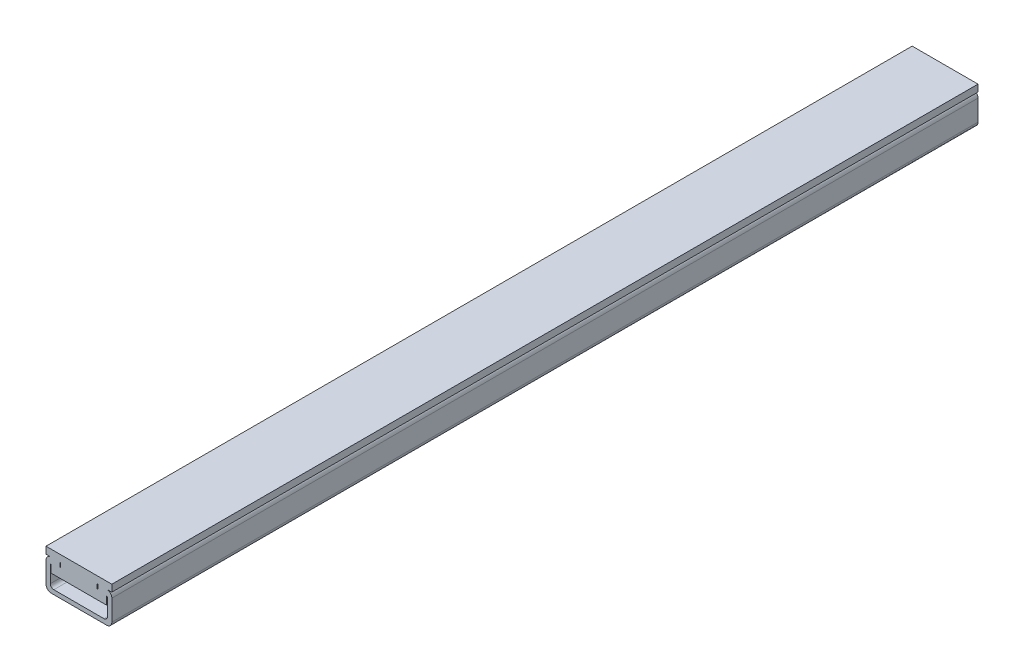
ISO-10303-21;
HEADER;
FILE_DESCRIPTION(('STEP AP214'),'2;1');
FILE_NAME('part.step','',(''),(''),'','','');
FILE_SCHEMA(('AUTOMOTIVE_DESIGN { 1 0 10303 214 1 1 1 1 }'));
ENDSEC;
DATA;
#1=APPLICATION_CONTEXT('core data for automotive mechanical design processes');
#2=APPLICATION_PROTOCOL_DEFINITION('international standard','automotive_design',2000,#1);
#3=PRODUCT_CONTEXT('',#1,'mechanical');
#4=PRODUCT('Part','Part','',(#3));
#5=PRODUCT_RELATED_PRODUCT_CATEGORY('part','',(#4));
#6=PRODUCT_DEFINITION_FORMATION('','',#4);
#7=PRODUCT_DEFINITION_CONTEXT('part definition',#1,'design');
#8=PRODUCT_DEFINITION('design','',#6,#7);
#9=PRODUCT_DEFINITION_SHAPE('','',#8);
#10=(LENGTH_UNIT() NAMED_UNIT(*) SI_UNIT(.MILLI.,.METRE.));
#11=(NAMED_UNIT(*) PLANE_ANGLE_UNIT() SI_UNIT($,.RADIAN.));
#12=(NAMED_UNIT(*) SI_UNIT($,.STERADIAN.) SOLID_ANGLE_UNIT());
#13=UNCERTAINTY_MEASURE_WITH_UNIT(LENGTH_MEASURE(1.E-05),#10,'distance_accuracy_value','');
#14=(GEOMETRIC_REPRESENTATION_CONTEXT(3) GLOBAL_UNCERTAINTY_ASSIGNED_CONTEXT((#13)) GLOBAL_UNIT_ASSIGNED_CONTEXT((#10,
#11,#12)) REPRESENTATION_CONTEXT('',''));
#15=CARTESIAN_POINT('',(0.,0.,0.));
#16=DIRECTION('',(0.,0.,1.));
#17=DIRECTION('',(1.,0.,0.));
#18=AXIS2_PLACEMENT_3D('',#15,#16,#17);
#19=CARTESIAN_POINT('',(-16.,15.,0.));
#20=DIRECTION('',(0.,0.,1.));
#21=DIRECTION('',(1.,0.,0.));
#22=AXIS2_PLACEMENT_3D('',#19,#20,#21);
#23=PLANE('',#22);
#24=DIRECTION('',(0.,-1.,0.));
#25=VECTOR('',#24,1.);
#26=CARTESIAN_POINT('',(11.,18.,0.));
#27=LINE('',#26,#25);
#28=CARTESIAN_POINT('',(11.,18.,0.));
#29=VERTEX_POINT('',#28);
#30=CARTESIAN_POINT('',(11.,15.5,0.));
#31=VERTEX_POINT('',#30);
#32=EDGE_CURVE('E239',#29,#31,#27,.T.);
#33=ORIENTED_EDGE('',*,*,#32,.F.);
#34=DIRECTION('',(-1.,0.,0.));
#35=VECTOR('',#34,1.);
#36=CARTESIAN_POINT('',(11.,18.,0.));
#37=LINE('',#36,#35);
#38=CARTESIAN_POINT('',(10.5,18.,0.));
#39=VERTEX_POINT('',#38);
#40=EDGE_CURVE('E230',#29,#39,#37,.T.);
#41=ORIENTED_EDGE('',*,*,#40,.T.);
#42=DIRECTION('',(0.,-1.,0.));
#43=VECTOR('',#42,1.);
#44=CARTESIAN_POINT('',(10.5,18.,0.));
#45=LINE('',#44,#43);
#46=CARTESIAN_POINT('',(10.5,15.5,0.));
#47=VERTEX_POINT('',#46);
#48=EDGE_CURVE('E236',#39,#47,#45,.T.);
#49=ORIENTED_EDGE('',*,*,#48,.T.);
#50=DIRECTION('',(-1.,0.,0.));
#51=VECTOR('',#50,1.);
#52=CARTESIAN_POINT('',(11.,15.5,0.));
#53=LINE('',#52,#51);
#54=EDGE_CURVE('E29',#31,#47,#53,.T.);
#55=ORIENTED_EDGE('',*,*,#54,.F.);
#56=EDGE_LOOP('',(#33,#41,#49,#55));
#57=FACE_BOUND('',#56,.T.);
#58=DIRECTION('',(0.,-1.,0.));
#59=VECTOR('',#58,1.);
#60=CARTESIAN_POINT('',(-16.,14.8228756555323,0.));
#61=LINE('',#60,#59);
#62=CARTESIAN_POINT('',(-16.,14.8228756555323,0.));
#63=VERTEX_POINT('',#62);
#64=CARTESIAN_POINT('',(-16.,10.,0.));
#65=VERTEX_POINT('',#64);
#66=EDGE_CURVE('E302',#63,#65,#61,.T.);
#67=ORIENTED_EDGE('',*,*,#66,.F.);
#68=CARTESIAN_POINT('',(-14.5,13.5,0.));
#69=DIRECTION('',(0.,0.,1.));
#70=DIRECTION('',(1.,0.,0.));
#71=AXIS2_PLACEMENT_3D('',#68,#69,#70);
#72=CIRCLE('',#71,2.);
#73=CARTESIAN_POINT('',(-16.5,13.5,0.));
#74=VERTEX_POINT('',#73);
#75=EDGE_CURVE('E275',#63,#74,#72,.T.);
#76=ORIENTED_EDGE('',*,*,#75,.T.);
#77=DIRECTION('',(0.,-1.,0.));
#78=VECTOR('',#77,1.);
#79=CARTESIAN_POINT('',(-16.5,13.5,0.));
#80=LINE('',#79,#78);
#81=CARTESIAN_POINT('',(-16.5,4.5,0.));
#82=VERTEX_POINT('',#81);
#83=EDGE_CURVE('E278',#74,#82,#80,.T.);
#84=ORIENTED_EDGE('',*,*,#83,.T.);
#85=CARTESIAN_POINT('',(-14.5,4.5,0.));
#86=DIRECTION('',(0.,0.,1.));
#87=DIRECTION('',(1.,0.,0.));
#88=AXIS2_PLACEMENT_3D('',#85,#86,#87);
#89=CIRCLE('',#88,2.);
#90=CARTESIAN_POINT('',(-14.5,2.5,0.));
#91=VERTEX_POINT('',#90);
#92=EDGE_CURVE('E281',#82,#91,#89,.T.);
#93=ORIENTED_EDGE('',*,*,#92,.T.);
#94=DIRECTION('',(-1.,0.,0.));
#95=VECTOR('',#94,1.);
#96=CARTESIAN_POINT('',(14.5,2.5,0.));
#97=LINE('',#96,#95);
#98=CARTESIAN_POINT('',(14.5,2.5,0.));
#99=VERTEX_POINT('',#98);
#100=EDGE_CURVE('E284',#99,#91,#97,.T.);
#101=ORIENTED_EDGE('',*,*,#100,.F.);
#102=CARTESIAN_POINT('',(14.5,4.5,0.));
#103=DIRECTION('',(0.,0.,1.));
#104=DIRECTION('',(1.,0.,0.));
#105=AXIS2_PLACEMENT_3D('',#102,#103,#104);
#106=CIRCLE('',#105,2.);
#107=CARTESIAN_POINT('',(16.5,4.5,0.));
#108=VERTEX_POINT('',#107);
#109=EDGE_CURVE('E287',#99,#108,#106,.T.);
#110=ORIENTED_EDGE('',*,*,#109,.T.);
#111=DIRECTION('',(0.,-1.,0.));
#112=VECTOR('',#111,1.);
#113=CARTESIAN_POINT('',(16.5,13.5,0.));
#114=LINE('',#113,#112);
#115=CARTESIAN_POINT('',(16.5,13.5,0.));
#116=VERTEX_POINT('',#115);
#117=EDGE_CURVE('E290',#116,#108,#114,.T.);
#118=ORIENTED_EDGE('',*,*,#117,.F.);
#119=CARTESIAN_POINT('',(14.5,13.5,0.));
#120=DIRECTION('',(0.,0.,1.));
#121=DIRECTION('',(1.,0.,0.));
#122=AXIS2_PLACEMENT_3D('',#119,#120,#121);
#123=CIRCLE('',#122,2.);
#124=CARTESIAN_POINT('',(16.,14.8228756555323,0.));
#125=VERTEX_POINT('',#124);
#126=EDGE_CURVE('E293',#116,#125,#123,.T.);
#127=ORIENTED_EDGE('',*,*,#126,.T.);
#128=DIRECTION('',(0.,1.,0.));
#129=VECTOR('',#128,1.);
#130=CARTESIAN_POINT('',(16.,10.,0.));
#131=LINE('',#130,#129);
#132=CARTESIAN_POINT('',(16.,10.,0.));
#133=VERTEX_POINT('',#132);
#134=EDGE_CURVE('E296',#133,#125,#131,.T.);
#135=ORIENTED_EDGE('',*,*,#134,.F.);
#136=DIRECTION('',(-1.,0.,0.));
#137=VECTOR('',#136,1.);
#138=CARTESIAN_POINT('',(16.,10.,0.));
#139=LINE('',#138,#137);
#140=EDGE_CURVE('E299',#133,#65,#139,.T.);
#141=ORIENTED_EDGE('',*,*,#140,.T.);
#142=EDGE_LOOP('',(#67,#76,#84,#93,#101,#110,#118,#127,#135,#141));
#143=FACE_BOUND('',#142,.T.);
#144=CARTESIAN_POINT('',(-16.,15.,0.));
#145=DIRECTION('',(0.,0.,1.));
#146=DIRECTION('',(1.,0.,0.));
#147=AXIS2_PLACEMENT_3D('',#144,#145,#146);
#148=CIRCLE('',#147,3.);
#149=CARTESIAN_POINT('',(-16.,18.,0.));
#150=VERTEX_POINT('',#149);
#151=CARTESIAN_POINT('',(-19.,15.,0.));
#152=VERTEX_POINT('',#151);
#153=EDGE_CURVE('E395',#150,#152,#148,.T.);
#154=ORIENTED_EDGE('',*,*,#153,.F.);
#155=DIRECTION('',(-1.,0.,0.));
#156=VECTOR('',#155,1.);
#157=CARTESIAN_POINT('',(-16.,18.,0.));
#158=LINE('',#157,#156);
#159=CARTESIAN_POINT('',(-19.,18.,0.));
#160=VERTEX_POINT('',#159);
#161=EDGE_CURVE('E428',#150,#160,#158,.T.);
#162=ORIENTED_EDGE('',*,*,#161,.T.);
#163=DIRECTION('',(0.,-1.,0.));
#164=VECTOR('',#163,1.);
#165=CARTESIAN_POINT('',(-19.,22.,0.));
#166=LINE('',#165,#164);
#167=CARTESIAN_POINT('',(-19.,22.,0.));
#168=VERTEX_POINT('',#167);
#169=EDGE_CURVE('E425',#168,#160,#166,.T.);
#170=ORIENTED_EDGE('',*,*,#169,.F.);
#171=DIRECTION('',(-1.,0.,0.));
#172=VECTOR('',#171,1.);
#173=CARTESIAN_POINT('',(19.,22.,0.));
#174=LINE('',#173,#172);
#175=CARTESIAN_POINT('',(19.,22.,0.));
#176=VERTEX_POINT('',#175);
#177=EDGE_CURVE('E422',#176,#168,#174,.T.);
#178=ORIENTED_EDGE('',*,*,#177,.F.);
#179=DIRECTION('',(0.,-1.,0.));
#180=VECTOR('',#179,1.);
#181=CARTESIAN_POINT('',(19.,22.,0.));
#182=LINE('',#181,#180);
#183=CARTESIAN_POINT('',(19.,18.,0.));
#184=VERTEX_POINT('',#183);
#185=EDGE_CURVE('E419',#176,#184,#182,.T.);
#186=ORIENTED_EDGE('',*,*,#185,.T.);
#187=DIRECTION('',(-1.,0.,0.));
#188=VECTOR('',#187,1.);
#189=CARTESIAN_POINT('',(19.,18.,0.));
#190=LINE('',#189,#188);
#191=CARTESIAN_POINT('',(16.,18.,0.));
#192=VERTEX_POINT('',#191);
#193=EDGE_CURVE('E416',#184,#192,#190,.T.);
#194=ORIENTED_EDGE('',*,*,#193,.T.);
#195=CARTESIAN_POINT('',(16.,15.,0.));
#196=DIRECTION('',(0.,0.,1.));
#197=DIRECTION('',(1.,0.,0.));
#198=AXIS2_PLACEMENT_3D('',#195,#196,#197);
#199=CIRCLE('',#198,3.);
#200=CARTESIAN_POINT('',(19.,15.,0.));
#201=VERTEX_POINT('',#200);
#202=EDGE_CURVE('E413',#201,#192,#199,.T.);
#203=ORIENTED_EDGE('',*,*,#202,.F.);
#204=DIRECTION('',(0.,-1.,0.));
#205=VECTOR('',#204,1.);
#206=CARTESIAN_POINT('',(19.,15.,0.));
#207=LINE('',#206,#205);
#208=CARTESIAN_POINT('',(19.,3.,0.));
#209=VERTEX_POINT('',#208);
#210=EDGE_CURVE('E410',#201,#209,#207,.T.);
#211=ORIENTED_EDGE('',*,*,#210,.T.);
#212=CARTESIAN_POINT('',(16.,3.,0.));
#213=DIRECTION('',(0.,0.,1.));
#214=DIRECTION('',(1.,0.,0.));
#215=AXIS2_PLACEMENT_3D('',#212,#213,#214);
#216=CIRCLE('',#215,3.);
#217=CARTESIAN_POINT('',(16.,0.,0.));
#218=VERTEX_POINT('',#217);
#219=EDGE_CURVE('E407',#218,#209,#216,.T.);
#220=ORIENTED_EDGE('',*,*,#219,.F.);
#221=DIRECTION('',(-1.,0.,0.));
#222=VECTOR('',#221,1.);
#223=CARTESIAN_POINT('',(16.,0.,0.));
#224=LINE('',#223,#222);
#225=CARTESIAN_POINT('',(-16.,0.,0.));
#226=VERTEX_POINT('',#225);
#227=EDGE_CURVE('E404',#218,#226,#224,.T.);
#228=ORIENTED_EDGE('',*,*,#227,.T.);
#229=CARTESIAN_POINT('',(-16.,3.,0.));
#230=DIRECTION('',(0.,0.,1.));
#231=DIRECTION('',(1.,0.,0.));
#232=AXIS2_PLACEMENT_3D('',#229,#230,#231);
#233=CIRCLE('',#232,3.);
#234=CARTESIAN_POINT('',(-19.,3.,0.));
#235=VERTEX_POINT('',#234);
#236=EDGE_CURVE('E401',#235,#226,#233,.T.);
#237=ORIENTED_EDGE('',*,*,#236,.F.);
#238=DIRECTION('',(0.,-1.,0.));
#239=VECTOR('',#238,1.);
#240=CARTESIAN_POINT('',(-19.,15.,0.));
#241=LINE('',#240,#239);
#242=EDGE_CURVE('E398',#152,#235,#241,.T.);
#243=ORIENTED_EDGE('',*,*,#242,.F.);
#244=EDGE_LOOP('',(#154,#162,#170,#178,#186,#194,#203,#211,#220,#228,#237,#243));
#245=FACE_BOUND('',#244,.T.);
#246=DIRECTION('',(0.,-1.,0.));
#247=VECTOR('',#246,1.);
#248=CARTESIAN_POINT('',(-10.5,18.,0.));
#249=LINE('',#248,#247);
#250=CARTESIAN_POINT('',(-10.5,18.,0.));
#251=VERTEX_POINT('',#250);
#252=CARTESIAN_POINT('',(-10.5,15.5,0.));
#253=VERTEX_POINT('',#252);
#254=EDGE_CURVE('E338',#251,#253,#249,.T.);
#255=ORIENTED_EDGE('',*,*,#254,.F.);
#256=DIRECTION('',(-1.,0.,0.));
#257=VECTOR('',#256,1.);
#258=CARTESIAN_POINT('',(-10.5,18.,0.));
#259=LINE('',#258,#257);
#260=CARTESIAN_POINT('',(-11.,18.,0.));
#261=VERTEX_POINT('',#260);
#262=EDGE_CURVE('E347',#251,#261,#259,.T.);
#263=ORIENTED_EDGE('',*,*,#262,.T.);
#264=DIRECTION('',(0.,-1.,0.));
#265=VECTOR('',#264,1.);
#266=CARTESIAN_POINT('',(-11.,18.,0.));
#267=LINE('',#266,#265);
#268=CARTESIAN_POINT('',(-11.,15.5,0.));
#269=VERTEX_POINT('',#268);
#270=EDGE_CURVE('E344',#261,#269,#267,.T.);
#271=ORIENTED_EDGE('',*,*,#270,.T.);
#272=DIRECTION('',(-1.,0.,0.));
#273=VECTOR('',#272,1.);
#274=CARTESIAN_POINT('',(-10.5,15.5,0.));
#275=LINE('',#274,#273);
#276=EDGE_CURVE('E341',#253,#269,#275,.T.);
#277=ORIENTED_EDGE('',*,*,#276,.F.);
#278=EDGE_LOOP('',(#255,#263,#271,#277));
#279=FACE_BOUND('',#278,.T.);
#280=ADVANCED_FACE('F14',(#57,#143,#245,#279),#23,.F.);
#281=CARTESIAN_POINT('',(-16.,15.,500.));
#282=DIRECTION('',(0.,0.,1.));
#283=DIRECTION('',(1.,0.,0.));
#284=AXIS2_PLACEMENT_3D('',#281,#282,#283);
#285=PLANE('',#284);
#286=DIRECTION('',(-1.,0.,0.));
#287=VECTOR('',#286,1.);
#288=CARTESIAN_POINT('',(11.,18.,500.));
#289=LINE('',#288,#287);
#290=CARTESIAN_POINT('',(11.,18.,500.));
#291=VERTEX_POINT('',#290);
#292=CARTESIAN_POINT('',(10.5,18.,500.));
#293=VERTEX_POINT('',#292);
#294=EDGE_CURVE('E37',#291,#293,#289,.T.);
#295=ORIENTED_EDGE('',*,*,#294,.F.);
#296=DIRECTION('',(0.,-1.,0.));
#297=VECTOR('',#296,1.);
#298=CARTESIAN_POINT('',(11.,18.,500.));
#299=LINE('',#298,#297);
#300=CARTESIAN_POINT('',(11.,15.5,500.));
#301=VERTEX_POINT('',#300);
#302=EDGE_CURVE('E228',#291,#301,#299,.T.);
#303=ORIENTED_EDGE('',*,*,#302,.T.);
#304=DIRECTION('',(-1.,0.,0.));
#305=VECTOR('',#304,1.);
#306=CARTESIAN_POINT('',(11.,15.5,500.));
#307=LINE('',#306,#305);
#308=CARTESIAN_POINT('',(10.5,15.5,500.));
#309=VERTEX_POINT('',#308);
#310=EDGE_CURVE('E212',#301,#309,#307,.T.);
#311=ORIENTED_EDGE('',*,*,#310,.T.);
#312=DIRECTION('',(0.,-1.,0.));
#313=VECTOR('',#312,1.);
#314=CARTESIAN_POINT('',(10.5,18.,500.));
#315=LINE('',#314,#313);
#316=EDGE_CURVE('E221',#293,#309,#315,.T.);
#317=ORIENTED_EDGE('',*,*,#316,.F.);
#318=EDGE_LOOP('',(#295,#303,#311,#317));
#319=FACE_BOUND('',#318,.T.);
#320=CARTESIAN_POINT('',(-14.5,13.5,500.));
#321=DIRECTION('',(0.,0.,1.));
#322=DIRECTION('',(1.,0.,0.));
#323=AXIS2_PLACEMENT_3D('',#320,#321,#322);
#324=CIRCLE('',#323,2.);
#325=CARTESIAN_POINT('',(-16.,14.8228756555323,500.));
#326=VERTEX_POINT('',#325);
#327=CARTESIAN_POINT('',(-16.5,13.5,500.));
#328=VERTEX_POINT('',#327);
#329=EDGE_CURVE('E246',#326,#328,#324,.T.);
#330=ORIENTED_EDGE('',*,*,#329,.F.);
#331=DIRECTION('',(0.,-1.,0.));
#332=VECTOR('',#331,1.);
#333=CARTESIAN_POINT('',(-16.,14.8228756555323,500.));
#334=LINE('',#333,#332);
#335=CARTESIAN_POINT('',(-16.,10.,500.));
#336=VERTEX_POINT('',#335);
#337=EDGE_CURVE('E272',#326,#336,#334,.T.);
#338=ORIENTED_EDGE('',*,*,#337,.T.);
#339=DIRECTION('',(-1.,0.,0.));
#340=VECTOR('',#339,1.);
#341=CARTESIAN_POINT('',(16.,10.,500.));
#342=LINE('',#341,#340);
#343=CARTESIAN_POINT('',(16.,10.,500.));
#344=VERTEX_POINT('',#343);
#345=EDGE_CURVE('E269',#344,#336,#342,.T.);
#346=ORIENTED_EDGE('',*,*,#345,.F.);
#347=DIRECTION('',(0.,1.,0.));
#348=VECTOR('',#347,1.);
#349=CARTESIAN_POINT('',(16.,10.,500.));
#350=LINE('',#349,#348);
#351=CARTESIAN_POINT('',(16.,14.8228756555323,500.));
#352=VERTEX_POINT('',#351);
#353=EDGE_CURVE('E266',#344,#352,#350,.T.);
#354=ORIENTED_EDGE('',*,*,#353,.T.);
#355=CARTESIAN_POINT('',(14.5,13.5,500.));
#356=DIRECTION('',(0.,0.,1.));
#357=DIRECTION('',(1.,0.,0.));
#358=AXIS2_PLACEMENT_3D('',#355,#356,#357);
#359=CIRCLE('',#358,2.);
#360=CARTESIAN_POINT('',(16.5,13.5,500.));
#361=VERTEX_POINT('',#360);
#362=EDGE_CURVE('E263',#361,#352,#359,.T.);
#363=ORIENTED_EDGE('',*,*,#362,.F.);
#364=DIRECTION('',(0.,-1.,0.));
#365=VECTOR('',#364,1.);
#366=CARTESIAN_POINT('',(16.5,13.5,500.));
#367=LINE('',#366,#365);
#368=CARTESIAN_POINT('',(16.5,4.5,500.));
#369=VERTEX_POINT('',#368);
#370=EDGE_CURVE('E260',#361,#369,#367,.T.);
#371=ORIENTED_EDGE('',*,*,#370,.T.);
#372=CARTESIAN_POINT('',(14.5,4.5,500.));
#373=DIRECTION('',(0.,0.,1.));
#374=DIRECTION('',(1.,0.,0.));
#375=AXIS2_PLACEMENT_3D('',#372,#373,#374);
#376=CIRCLE('',#375,2.);
#377=CARTESIAN_POINT('',(14.5,2.5,500.));
#378=VERTEX_POINT('',#377);
#379=EDGE_CURVE('E257',#378,#369,#376,.T.);
#380=ORIENTED_EDGE('',*,*,#379,.F.);
#381=DIRECTION('',(-1.,0.,0.));
#382=VECTOR('',#381,1.);
#383=CARTESIAN_POINT('',(14.5,2.5,500.));
#384=LINE('',#383,#382);
#385=CARTESIAN_POINT('',(-14.5,2.5,500.));
#386=VERTEX_POINT('',#385);
#387=EDGE_CURVE('E254',#378,#386,#384,.T.);
#388=ORIENTED_EDGE('',*,*,#387,.T.);
#389=CARTESIAN_POINT('',(-14.5,4.5,500.));
#390=DIRECTION('',(0.,0.,1.));
#391=DIRECTION('',(1.,0.,0.));
#392=AXIS2_PLACEMENT_3D('',#389,#390,#391);
#393=CIRCLE('',#392,2.);
#394=CARTESIAN_POINT('',(-16.5,4.5,500.));
#395=VERTEX_POINT('',#394);
#396=EDGE_CURVE('E251',#395,#386,#393,.T.);
#397=ORIENTED_EDGE('',*,*,#396,.F.);
#398=DIRECTION('',(0.,-1.,0.));
#399=VECTOR('',#398,1.);
#400=CARTESIAN_POINT('',(-16.5,13.5,500.));
#401=LINE('',#400,#399);
#402=EDGE_CURVE('E248',#328,#395,#401,.T.);
#403=ORIENTED_EDGE('',*,*,#402,.F.);
#404=EDGE_LOOP('',(#330,#338,#346,#354,#363,#371,#380,#388,#397,#403));
#405=FACE_BOUND('',#404,.T.);
#406=CARTESIAN_POINT('',(-16.,15.,500.));
#407=DIRECTION('',(0.,0.,1.));
#408=DIRECTION('',(1.,0.,0.));
#409=AXIS2_PLACEMENT_3D('',#406,#407,#408);
#410=CIRCLE('',#409,3.);
#411=CARTESIAN_POINT('',(-16.,18.,500.));
#412=VERTEX_POINT('',#411);
#413=CARTESIAN_POINT('',(-19.,15.,500.));
#414=VERTEX_POINT('',#413);
#415=EDGE_CURVE('E359',#412,#414,#410,.T.);
#416=ORIENTED_EDGE('',*,*,#415,.T.);
#417=DIRECTION('',(0.,-1.,0.));
#418=VECTOR('',#417,1.);
#419=CARTESIAN_POINT('',(-19.,15.,500.));
#420=LINE('',#419,#418);
#421=CARTESIAN_POINT('',(-19.,3.,500.));
#422=VERTEX_POINT('',#421);
#423=EDGE_CURVE('E362',#414,#422,#420,.T.);
#424=ORIENTED_EDGE('',*,*,#423,.T.);
#425=CARTESIAN_POINT('',(-16.,3.,500.));
#426=DIRECTION('',(0.,0.,1.));
#427=DIRECTION('',(1.,0.,0.));
#428=AXIS2_PLACEMENT_3D('',#425,#426,#427);
#429=CIRCLE('',#428,3.);
#430=CARTESIAN_POINT('',(-16.,0.,500.));
#431=VERTEX_POINT('',#430);
#432=EDGE_CURVE('E365',#422,#431,#429,.T.);
#433=ORIENTED_EDGE('',*,*,#432,.T.);
#434=DIRECTION('',(-1.,0.,0.));
#435=VECTOR('',#434,1.);
#436=CARTESIAN_POINT('',(16.,0.,500.));
#437=LINE('',#436,#435);
#438=CARTESIAN_POINT('',(16.,0.,500.));
#439=VERTEX_POINT('',#438);
#440=EDGE_CURVE('E368',#439,#431,#437,.T.);
#441=ORIENTED_EDGE('',*,*,#440,.F.);
#442=CARTESIAN_POINT('',(16.,3.,500.));
#443=DIRECTION('',(0.,0.,1.));
#444=DIRECTION('',(1.,0.,0.));
#445=AXIS2_PLACEMENT_3D('',#442,#443,#444);
#446=CIRCLE('',#445,3.);
#447=CARTESIAN_POINT('',(19.,3.,500.));
#448=VERTEX_POINT('',#447);
#449=EDGE_CURVE('E371',#439,#448,#446,.T.);
#450=ORIENTED_EDGE('',*,*,#449,.T.);
#451=DIRECTION('',(0.,-1.,0.));
#452=VECTOR('',#451,1.);
#453=CARTESIAN_POINT('',(19.,15.,500.));
#454=LINE('',#453,#452);
#455=CARTESIAN_POINT('',(19.,15.,500.));
#456=VERTEX_POINT('',#455);
#457=EDGE_CURVE('E374',#456,#448,#454,.T.);
#458=ORIENTED_EDGE('',*,*,#457,.F.);
#459=CARTESIAN_POINT('',(16.,15.,500.));
#460=DIRECTION('',(0.,0.,1.));
#461=DIRECTION('',(1.,0.,0.));
#462=AXIS2_PLACEMENT_3D('',#459,#460,#461);
#463=CIRCLE('',#462,3.);
#464=CARTESIAN_POINT('',(16.,18.,500.));
#465=VERTEX_POINT('',#464);
#466=EDGE_CURVE('E377',#456,#465,#463,.T.);
#467=ORIENTED_EDGE('',*,*,#466,.T.);
#468=DIRECTION('',(-1.,0.,0.));
#469=VECTOR('',#468,1.);
#470=CARTESIAN_POINT('',(19.,18.,500.));
#471=LINE('',#470,#469);
#472=CARTESIAN_POINT('',(19.,18.,500.));
#473=VERTEX_POINT('',#472);
#474=EDGE_CURVE('E380',#473,#465,#471,.T.);
#475=ORIENTED_EDGE('',*,*,#474,.F.);
#476=DIRECTION('',(0.,-1.,0.));
#477=VECTOR('',#476,1.);
#478=CARTESIAN_POINT('',(19.,22.,500.));
#479=LINE('',#478,#477);
#480=CARTESIAN_POINT('',(19.,22.,500.));
#481=VERTEX_POINT('',#480);
#482=EDGE_CURVE('E383',#481,#473,#479,.T.);
#483=ORIENTED_EDGE('',*,*,#482,.F.);
#484=DIRECTION('',(-1.,0.,0.));
#485=VECTOR('',#484,1.);
#486=CARTESIAN_POINT('',(19.,22.,500.));
#487=LINE('',#486,#485);
#488=CARTESIAN_POINT('',(-19.,22.,500.));
#489=VERTEX_POINT('',#488);
#490=EDGE_CURVE('E386',#481,#489,#487,.T.);
#491=ORIENTED_EDGE('',*,*,#490,.T.);
#492=DIRECTION('',(0.,-1.,0.));
#493=VECTOR('',#492,1.);
#494=CARTESIAN_POINT('',(-19.,22.,500.));
#495=LINE('',#494,#493);
#496=CARTESIAN_POINT('',(-19.,18.,500.));
#497=VERTEX_POINT('',#496);
#498=EDGE_CURVE('E389',#489,#497,#495,.T.);
#499=ORIENTED_EDGE('',*,*,#498,.T.);
#500=DIRECTION('',(-1.,0.,0.));
#501=VECTOR('',#500,1.);
#502=CARTESIAN_POINT('',(-16.,18.,500.));
#503=LINE('',#502,#501);
#504=EDGE_CURVE('E392',#412,#497,#503,.T.);
#505=ORIENTED_EDGE('',*,*,#504,.F.);
#506=EDGE_LOOP('',(#416,#424,#433,#441,#450,#458,#467,#475,#483,#491,#499,#505));
#507=FACE_BOUND('',#506,.T.);
#508=DIRECTION('',(-1.,0.,0.));
#509=VECTOR('',#508,1.);
#510=CARTESIAN_POINT('',(-10.5,18.,500.));
#511=LINE('',#510,#509);
#512=CARTESIAN_POINT('',(-10.5,18.,500.));
#513=VERTEX_POINT('',#512);
#514=CARTESIAN_POINT('',(-11.,18.,500.));
#515=VERTEX_POINT('',#514);
#516=EDGE_CURVE('E335',#513,#515,#511,.T.);
#517=ORIENTED_EDGE('',*,*,#516,.F.);
#518=DIRECTION('',(0.,-1.,0.));
#519=VECTOR('',#518,1.);
#520=CARTESIAN_POINT('',(-10.5,18.,500.));
#521=LINE('',#520,#519);
#522=CARTESIAN_POINT('',(-10.5,15.5,500.));
#523=VERTEX_POINT('',#522);
#524=EDGE_CURVE('E326',#513,#523,#521,.T.);
#525=ORIENTED_EDGE('',*,*,#524,.T.);
#526=DIRECTION('',(-1.,0.,0.));
#527=VECTOR('',#526,1.);
#528=CARTESIAN_POINT('',(-10.5,15.5,500.));
#529=LINE('',#528,#527);
#530=CARTESIAN_POINT('',(-11.,15.5,500.));
#531=VERTEX_POINT('',#530);
#532=EDGE_CURVE('E329',#523,#531,#529,.T.);
#533=ORIENTED_EDGE('',*,*,#532,.T.);
#534=DIRECTION('',(0.,-1.,0.));
#535=VECTOR('',#534,1.);
#536=CARTESIAN_POINT('',(-11.,18.,500.));
#537=LINE('',#536,#535);
#538=EDGE_CURVE('E332',#515,#531,#537,.T.);
#539=ORIENTED_EDGE('',*,*,#538,.F.);
#540=EDGE_LOOP('',(#517,#525,#533,#539));
#541=FACE_BOUND('',#540,.T.);
#542=ADVANCED_FACE('F225',(#319,#405,#507,#541),#285,.T.);
#543=CARTESIAN_POINT('',(-16.,15.,0.));
#544=DIRECTION('',(0.,0.,1.));
#545=DIRECTION('',(1.,0.,0.));
#546=AXIS2_PLACEMENT_3D('',#543,#544,#545);
#547=CYLINDRICAL_SURFACE('',#546,3.);
#548=DIRECTION('',(0.,0.,1.));
#549=VECTOR('',#548,1.);
#550=CARTESIAN_POINT('',(-16.,18.,0.));
#551=LINE('',#550,#549);
#552=EDGE_CURVE('E9',#150,#412,#551,.T.);
#553=ORIENTED_EDGE('',*,*,#552,.F.);
#554=ORIENTED_EDGE('',*,*,#153,.T.);
#555=DIRECTION('',(0.,0.,1.));
#556=VECTOR('',#555,1.);
#557=CARTESIAN_POINT('',(-19.,15.,0.));
#558=LINE('',#557,#556);
#559=EDGE_CURVE('E431',#152,#414,#558,.T.);
#560=ORIENTED_EDGE('',*,*,#559,.T.);
#561=ORIENTED_EDGE('',*,*,#415,.F.);
#562=EDGE_LOOP('',(#553,#554,#560,#561));
#563=FACE_BOUND('',#562,.T.);
#564=ADVANCED_FACE('F464',(#563),#547,.T.);
#565=CARTESIAN_POINT('',(-16.,18.,0.));
#566=DIRECTION('',(0.,1.,0.));
#567=DIRECTION('',(0.,0.,1.));
#568=AXIS2_PLACEMENT_3D('',#565,#566,#567);
#569=PLANE('',#568);
#570=DIRECTION('',(0.,0.,1.));
#571=VECTOR('',#570,1.);
#572=CARTESIAN_POINT('',(-19.,18.,0.));
#573=LINE('',#572,#571);
#574=EDGE_CURVE('E22',#160,#497,#573,.T.);
#575=ORIENTED_EDGE('',*,*,#574,.F.);
#576=ORIENTED_EDGE('',*,*,#161,.F.);
#577=ORIENTED_EDGE('',*,*,#552,.T.);
#578=ORIENTED_EDGE('',*,*,#504,.T.);
#579=EDGE_LOOP('',(#575,#576,#577,#578));
#580=FACE_BOUND('',#579,.T.);
#581=ADVANCED_FACE('F16',(#580),#569,.F.);
#582=CARTESIAN_POINT('',(-19.,22.,0.));
#583=DIRECTION('',(-1.,0.,0.));
#584=DIRECTION('',(0.,0.,1.));
#585=AXIS2_PLACEMENT_3D('',#582,#583,#584);
#586=PLANE('',#585);
#587=DIRECTION('',(0.,0.,1.));
#588=VECTOR('',#587,1.);
#589=CARTESIAN_POINT('',(-19.,22.,0.));
#590=LINE('',#589,#588);
#591=EDGE_CURVE('E449',#168,#489,#590,.T.);
#592=ORIENTED_EDGE('',*,*,#591,.F.);
#593=ORIENTED_EDGE('',*,*,#169,.T.);
#594=ORIENTED_EDGE('',*,*,#574,.T.);
#595=ORIENTED_EDGE('',*,*,#498,.F.);
#596=EDGE_LOOP('',(#592,#593,#594,#595));
#597=FACE_BOUND('',#596,.T.);
#598=ADVANCED_FACE('F452',(#597),#586,.T.);
#599=CARTESIAN_POINT('',(19.,22.,0.));
#600=DIRECTION('',(0.,1.,0.));
#601=DIRECTION('',(0.,0.,1.));
#602=AXIS2_PLACEMENT_3D('',#599,#600,#601);
#603=PLANE('',#602);
#604=DIRECTION('',(0.,0.,1.));
#605=VECTOR('',#604,1.);
#606=CARTESIAN_POINT('',(19.,22.,0.));
#607=LINE('',#606,#605);
#608=EDGE_CURVE('E447',#176,#481,#607,.T.);
#609=ORIENTED_EDGE('',*,*,#608,.F.);
#610=ORIENTED_EDGE('',*,*,#177,.T.);
#611=ORIENTED_EDGE('',*,*,#591,.T.);
#612=ORIENTED_EDGE('',*,*,#490,.F.);
#613=EDGE_LOOP('',(#609,#610,#611,#612));
#614=FACE_BOUND('',#613,.T.);
#615=ADVANCED_FACE('F498',(#614),#603,.T.);
#616=CARTESIAN_POINT('',(19.,22.,0.));
#617=DIRECTION('',(-1.,0.,0.));
#618=DIRECTION('',(0.,0.,1.));
#619=AXIS2_PLACEMENT_3D('',#616,#617,#618);
#620=PLANE('',#619);
#621=DIRECTION('',(0.,0.,1.));
#622=VECTOR('',#621,1.);
#623=CARTESIAN_POINT('',(19.,18.,0.));
#624=LINE('',#623,#622);
#625=EDGE_CURVE('E445',#184,#473,#624,.T.);
#626=ORIENTED_EDGE('',*,*,#625,.F.);
#627=ORIENTED_EDGE('',*,*,#185,.F.);
#628=ORIENTED_EDGE('',*,*,#608,.T.);
#629=ORIENTED_EDGE('',*,*,#482,.T.);
#630=EDGE_LOOP('',(#626,#627,#628,#629));
#631=FACE_BOUND('',#630,.T.);
#632=ADVANCED_FACE('F495',(#631),#620,.F.);
#633=CARTESIAN_POINT('',(19.,18.,0.));
#634=DIRECTION('',(0.,1.,0.));
#635=DIRECTION('',(0.,0.,1.));
#636=AXIS2_PLACEMENT_3D('',#633,#634,#635);
#637=PLANE('',#636);
#638=DIRECTION('',(0.,0.,1.));
#639=VECTOR('',#638,1.);
#640=CARTESIAN_POINT('',(16.,18.,0.));
#641=LINE('',#640,#639);
#642=EDGE_CURVE('E443',#192,#465,#641,.T.);
#643=ORIENTED_EDGE('',*,*,#642,.F.);
#644=ORIENTED_EDGE('',*,*,#193,.F.);
#645=ORIENTED_EDGE('',*,*,#625,.T.);
#646=ORIENTED_EDGE('',*,*,#474,.T.);
#647=EDGE_LOOP('',(#643,#644,#645,#646));
#648=FACE_BOUND('',#647,.T.);
#649=ADVANCED_FACE('F491',(#648),#637,.F.);
#650=CARTESIAN_POINT('',(16.,15.,0.));
#651=DIRECTION('',(0.,0.,1.));
#652=DIRECTION('',(1.,0.,0.));
#653=AXIS2_PLACEMENT_3D('',#650,#651,#652);
#654=CYLINDRICAL_SURFACE('',#653,3.);
#655=DIRECTION('',(0.,0.,1.));
#656=VECTOR('',#655,1.);
#657=CARTESIAN_POINT('',(19.,15.,0.));
#658=LINE('',#657,#656);
#659=EDGE_CURVE('E441',#201,#456,#658,.T.);
#660=ORIENTED_EDGE('',*,*,#659,.F.);
#661=ORIENTED_EDGE('',*,*,#202,.T.);
#662=ORIENTED_EDGE('',*,*,#642,.T.);
#663=ORIENTED_EDGE('',*,*,#466,.F.);
#664=EDGE_LOOP('',(#660,#661,#662,#663));
#665=FACE_BOUND('',#664,.T.);
#666=ADVANCED_FACE('F488',(#665),#654,.T.);
#667=CARTESIAN_POINT('',(19.,15.,0.));
#668=DIRECTION('',(-1.,0.,0.));
#669=DIRECTION('',(0.,0.,1.));
#670=AXIS2_PLACEMENT_3D('',#667,#668,#669);
#671=PLANE('',#670);
#672=DIRECTION('',(0.,0.,1.));
#673=VECTOR('',#672,1.);
#674=CARTESIAN_POINT('',(19.,3.,0.));
#675=LINE('',#674,#673);
#676=EDGE_CURVE('E439',#209,#448,#675,.T.);
#677=ORIENTED_EDGE('',*,*,#676,.F.);
#678=ORIENTED_EDGE('',*,*,#210,.F.);
#679=ORIENTED_EDGE('',*,*,#659,.T.);
#680=ORIENTED_EDGE('',*,*,#457,.T.);
#681=EDGE_LOOP('',(#677,#678,#679,#680));
#682=FACE_BOUND('',#681,.T.);
#683=ADVANCED_FACE('F484',(#682),#671,.F.);
#684=CARTESIAN_POINT('',(16.,3.,0.));
#685=DIRECTION('',(0.,0.,1.));
#686=DIRECTION('',(1.,0.,0.));
#687=AXIS2_PLACEMENT_3D('',#684,#685,#686);
#688=CYLINDRICAL_SURFACE('',#687,3.);
#689=DIRECTION('',(0.,0.,1.));
#690=VECTOR('',#689,1.);
#691=CARTESIAN_POINT('',(16.,0.,0.));
#692=LINE('',#691,#690);
#693=EDGE_CURVE('E437',#218,#439,#692,.T.);
#694=ORIENTED_EDGE('',*,*,#693,.F.);
#695=ORIENTED_EDGE('',*,*,#219,.T.);
#696=ORIENTED_EDGE('',*,*,#676,.T.);
#697=ORIENTED_EDGE('',*,*,#449,.F.);
#698=EDGE_LOOP('',(#694,#695,#696,#697));
#699=FACE_BOUND('',#698,.T.);
#700=ADVANCED_FACE('F480',(#699),#688,.T.);
#701=CARTESIAN_POINT('',(16.,0.,0.));
#702=DIRECTION('',(0.,1.,0.));
#703=DIRECTION('',(0.,0.,1.));
#704=AXIS2_PLACEMENT_3D('',#701,#702,#703);
#705=PLANE('',#704);
#706=DIRECTION('',(0.,0.,1.));
#707=VECTOR('',#706,1.);
#708=CARTESIAN_POINT('',(-16.,0.,0.));
#709=LINE('',#708,#707);
#710=EDGE_CURVE('E435',#226,#431,#709,.T.);
#711=ORIENTED_EDGE('',*,*,#710,.F.);
#712=ORIENTED_EDGE('',*,*,#227,.F.);
#713=ORIENTED_EDGE('',*,*,#693,.T.);
#714=ORIENTED_EDGE('',*,*,#440,.T.);
#715=EDGE_LOOP('',(#711,#712,#713,#714));
#716=FACE_BOUND('',#715,.T.);
#717=ADVANCED_FACE('F476',(#716),#705,.F.);
#718=CARTESIAN_POINT('',(-16.,3.,0.));
#719=DIRECTION('',(0.,0.,1.));
#720=DIRECTION('',(1.,0.,0.));
#721=AXIS2_PLACEMENT_3D('',#718,#719,#720);
#722=CYLINDRICAL_SURFACE('',#721,3.);
#723=DIRECTION('',(0.,0.,1.));
#724=VECTOR('',#723,1.);
#725=CARTESIAN_POINT('',(-19.,3.,0.));
#726=LINE('',#725,#724);
#727=EDGE_CURVE('E433',#235,#422,#726,.T.);
#728=ORIENTED_EDGE('',*,*,#727,.F.);
#729=ORIENTED_EDGE('',*,*,#236,.T.);
#730=ORIENTED_EDGE('',*,*,#710,.T.);
#731=ORIENTED_EDGE('',*,*,#432,.F.);
#732=EDGE_LOOP('',(#728,#729,#730,#731));
#733=FACE_BOUND('',#732,.T.);
#734=ADVANCED_FACE('F472',(#733),#722,.T.);
#735=CARTESIAN_POINT('',(-19.,15.,0.));
#736=DIRECTION('',(-1.,0.,0.));
#737=DIRECTION('',(0.,0.,1.));
#738=AXIS2_PLACEMENT_3D('',#735,#736,#737);
#739=PLANE('',#738);
#740=ORIENTED_EDGE('',*,*,#242,.T.);
#741=ORIENTED_EDGE('',*,*,#727,.T.);
#742=ORIENTED_EDGE('',*,*,#423,.F.);
#743=ORIENTED_EDGE('',*,*,#559,.F.);
#744=EDGE_LOOP('',(#740,#741,#742,#743));
#745=FACE_BOUND('',#744,.T.);
#746=ADVANCED_FACE('F468',(#745),#739,.T.);
#747=CARTESIAN_POINT('',(-10.5,18.,0.));
#748=DIRECTION('',(-1.,0.,0.));
#749=DIRECTION('',(0.,0.,1.));
#750=AXIS2_PLACEMENT_3D('',#747,#748,#749);
#751=PLANE('',#750);
#752=DIRECTION('',(0.,0.,1.));
#753=VECTOR('',#752,1.);
#754=CARTESIAN_POINT('',(-10.5,15.5,0.));
#755=LINE('',#754,#753);
#756=EDGE_CURVE('E357',#253,#523,#755,.T.);
#757=ORIENTED_EDGE('',*,*,#756,.T.);
#758=ORIENTED_EDGE('',*,*,#524,.F.);
#759=DIRECTION('',(0.,0.,1.));
#760=VECTOR('',#759,1.);
#761=CARTESIAN_POINT('',(-10.5,18.,0.));
#762=LINE('',#761,#760);
#763=EDGE_CURVE('E350',#251,#513,#762,.T.);
#764=ORIENTED_EDGE('',*,*,#763,.F.);
#765=ORIENTED_EDGE('',*,*,#254,.T.);
#766=EDGE_LOOP('',(#757,#758,#764,#765));
#767=FACE_BOUND('',#766,.T.);
#768=ADVANCED_FACE('F508',(#767),#751,.T.);
#769=CARTESIAN_POINT('',(-10.5,15.5,0.));
#770=DIRECTION('',(0.,1.,0.));
#771=DIRECTION('',(0.,0.,1.));
#772=AXIS2_PLACEMENT_3D('',#769,#770,#771);
#773=PLANE('',#772);
#774=DIRECTION('',(0.,0.,1.));
#775=VECTOR('',#774,1.);
#776=CARTESIAN_POINT('',(-11.,15.5,0.));
#777=LINE('',#776,#775);
#778=EDGE_CURVE('E355',#269,#531,#777,.T.);
#779=ORIENTED_EDGE('',*,*,#778,.T.);
#780=ORIENTED_EDGE('',*,*,#532,.F.);
#781=ORIENTED_EDGE('',*,*,#756,.F.);
#782=ORIENTED_EDGE('',*,*,#276,.T.);
#783=EDGE_LOOP('',(#779,#780,#781,#782));
#784=FACE_BOUND('',#783,.T.);
#785=ADVANCED_FACE('F518',(#784),#773,.T.);
#786=CARTESIAN_POINT('',(-11.,18.,0.));
#787=DIRECTION('',(-1.,0.,0.));
#788=DIRECTION('',(0.,0.,1.));
#789=AXIS2_PLACEMENT_3D('',#786,#787,#788);
#790=PLANE('',#789);
#791=DIRECTION('',(0.,0.,1.));
#792=VECTOR('',#791,1.);
#793=CARTESIAN_POINT('',(-11.,18.,0.));
#794=LINE('',#793,#792);
#795=EDGE_CURVE('E353',#261,#515,#794,.T.);
#796=ORIENTED_EDGE('',*,*,#795,.T.);
#797=ORIENTED_EDGE('',*,*,#538,.T.);
#798=ORIENTED_EDGE('',*,*,#778,.F.);
#799=ORIENTED_EDGE('',*,*,#270,.F.);
#800=EDGE_LOOP('',(#796,#797,#798,#799));
#801=FACE_BOUND('',#800,.T.);
#802=ADVANCED_FACE('F516',(#801),#790,.F.);
#803=CARTESIAN_POINT('',(-10.5,18.,0.));
#804=DIRECTION('',(0.,1.,0.));
#805=DIRECTION('',(0.,0.,1.));
#806=AXIS2_PLACEMENT_3D('',#803,#804,#805);
#807=PLANE('',#806);
#808=ORIENTED_EDGE('',*,*,#262,.F.);
#809=ORIENTED_EDGE('',*,*,#763,.T.);
#810=ORIENTED_EDGE('',*,*,#516,.T.);
#811=ORIENTED_EDGE('',*,*,#795,.F.);
#812=EDGE_LOOP('',(#808,#809,#810,#811));
#813=FACE_BOUND('',#812,.T.);
#814=ADVANCED_FACE('F513',(#813),#807,.F.);
#815=CARTESIAN_POINT('',(-14.5,13.5,0.));
#816=DIRECTION('',(0.,0.,1.));
#817=DIRECTION('',(1.,0.,0.));
#818=AXIS2_PLACEMENT_3D('',#815,#816,#817);
#819=CYLINDRICAL_SURFACE('',#818,2.);
#820=DIRECTION('',(0.,0.,1.));
#821=VECTOR('',#820,1.);
#822=CARTESIAN_POINT('',(-16.,14.8228756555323,0.));
#823=LINE('',#822,#821);
#824=EDGE_CURVE('E324',#63,#326,#823,.T.);
#825=ORIENTED_EDGE('',*,*,#824,.T.);
#826=ORIENTED_EDGE('',*,*,#329,.T.);
#827=DIRECTION('',(0.,0.,1.));
#828=VECTOR('',#827,1.);
#829=CARTESIAN_POINT('',(-16.5,13.5,0.));
#830=LINE('',#829,#828);
#831=EDGE_CURVE('E305',#74,#328,#830,.T.);
#832=ORIENTED_EDGE('',*,*,#831,.F.);
#833=ORIENTED_EDGE('',*,*,#75,.F.);
#834=EDGE_LOOP('',(#825,#826,#832,#833));
#835=FACE_BOUND('',#834,.T.);
#836=ADVANCED_FACE('F655',(#835),#819,.F.);
#837=CARTESIAN_POINT('',(-16.,14.8228756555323,0.));
#838=DIRECTION('',(-1.,0.,0.));
#839=DIRECTION('',(0.,0.,1.));
#840=AXIS2_PLACEMENT_3D('',#837,#838,#839);
#841=PLANE('',#840);
#842=DIRECTION('',(0.,0.,1.));
#843=VECTOR('',#842,1.);
#844=CARTESIAN_POINT('',(-16.,10.,0.));
#845=LINE('',#844,#843);
#846=EDGE_CURVE('E322',#65,#336,#845,.T.);
#847=ORIENTED_EDGE('',*,*,#846,.T.);
#848=ORIENTED_EDGE('',*,*,#337,.F.);
#849=ORIENTED_EDGE('',*,*,#824,.F.);
#850=ORIENTED_EDGE('',*,*,#66,.T.);
#851=EDGE_LOOP('',(#847,#848,#849,#850));
#852=FACE_BOUND('',#851,.T.);
#853=ADVANCED_FACE('F663',(#852),#841,.T.);
#854=CARTESIAN_POINT('',(16.,10.,0.));
#855=DIRECTION('',(0.,1.,0.));
#856=DIRECTION('',(0.,0.,1.));
#857=AXIS2_PLACEMENT_3D('',#854,#855,#856);
#858=PLANE('',#857);
#859=DIRECTION('',(0.,0.,1.));
#860=VECTOR('',#859,1.);
#861=CARTESIAN_POINT('',(16.,10.,0.));
#862=LINE('',#861,#860);
#863=EDGE_CURVE('E320',#133,#344,#862,.T.);
#864=ORIENTED_EDGE('',*,*,#863,.T.);
#865=ORIENTED_EDGE('',*,*,#345,.T.);
#866=ORIENTED_EDGE('',*,*,#846,.F.);
#867=ORIENTED_EDGE('',*,*,#140,.F.);
#868=EDGE_LOOP('',(#864,#865,#866,#867));
#869=FACE_BOUND('',#868,.T.);
#870=ADVANCED_FACE('F672',(#869),#858,.F.);
#871=CARTESIAN_POINT('',(16.,10.,0.));
#872=DIRECTION('',(1.,0.,0.));
#873=DIRECTION('',(0.,0.,-1.));
#874=AXIS2_PLACEMENT_3D('',#871,#872,#873);
#875=PLANE('',#874);
#876=DIRECTION('',(0.,0.,1.));
#877=VECTOR('',#876,1.);
#878=CARTESIAN_POINT('',(16.,14.8228756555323,0.));
#879=LINE('',#878,#877);
#880=EDGE_CURVE('E318',#125,#352,#879,.T.);
#881=ORIENTED_EDGE('',*,*,#880,.T.);
#882=ORIENTED_EDGE('',*,*,#353,.F.);
#883=ORIENTED_EDGE('',*,*,#863,.F.);
#884=ORIENTED_EDGE('',*,*,#134,.T.);
#885=EDGE_LOOP('',(#881,#882,#883,#884));
#886=FACE_BOUND('',#885,.T.);
#887=ADVANCED_FACE('F681',(#886),#875,.T.);
#888=CARTESIAN_POINT('',(14.5,13.5,0.));
#889=DIRECTION('',(0.,0.,1.));
#890=DIRECTION('',(1.,0.,0.));
#891=AXIS2_PLACEMENT_3D('',#888,#889,#890);
#892=CYLINDRICAL_SURFACE('',#891,2.);
#893=DIRECTION('',(0.,0.,1.));
#894=VECTOR('',#893,1.);
#895=CARTESIAN_POINT('',(16.5,13.5,0.));
#896=LINE('',#895,#894);
#897=EDGE_CURVE('E316',#116,#361,#896,.T.);
#898=ORIENTED_EDGE('',*,*,#897,.T.);
#899=ORIENTED_EDGE('',*,*,#362,.T.);
#900=ORIENTED_EDGE('',*,*,#880,.F.);
#901=ORIENTED_EDGE('',*,*,#126,.F.);
#902=EDGE_LOOP('',(#898,#899,#900,#901));
#903=FACE_BOUND('',#902,.T.);
#904=ADVANCED_FACE('F690',(#903),#892,.F.);
#905=CARTESIAN_POINT('',(16.5,13.5,0.));
#906=DIRECTION('',(-1.,0.,0.));
#907=DIRECTION('',(0.,0.,1.));
#908=AXIS2_PLACEMENT_3D('',#905,#906,#907);
#909=PLANE('',#908);
#910=DIRECTION('',(0.,0.,1.));
#911=VECTOR('',#910,1.);
#912=CARTESIAN_POINT('',(16.5,4.5,0.));
#913=LINE('',#912,#911);
#914=EDGE_CURVE('E314',#108,#369,#913,.T.);
#915=ORIENTED_EDGE('',*,*,#914,.T.);
#916=ORIENTED_EDGE('',*,*,#370,.F.);
#917=ORIENTED_EDGE('',*,*,#897,.F.);
#918=ORIENTED_EDGE('',*,*,#117,.T.);
#919=EDGE_LOOP('',(#915,#916,#917,#918));
#920=FACE_BOUND('',#919,.T.);
#921=ADVANCED_FACE('F699',(#920),#909,.T.);
#922=CARTESIAN_POINT('',(14.5,4.5,0.));
#923=DIRECTION('',(0.,0.,1.));
#924=DIRECTION('',(1.,0.,0.));
#925=AXIS2_PLACEMENT_3D('',#922,#923,#924);
#926=CYLINDRICAL_SURFACE('',#925,2.);
#927=DIRECTION('',(0.,0.,1.));
#928=VECTOR('',#927,1.);
#929=CARTESIAN_POINT('',(14.5,2.5,0.));
#930=LINE('',#929,#928);
#931=EDGE_CURVE('E312',#99,#378,#930,.T.);
#932=ORIENTED_EDGE('',*,*,#931,.T.);
#933=ORIENTED_EDGE('',*,*,#379,.T.);
#934=ORIENTED_EDGE('',*,*,#914,.F.);
#935=ORIENTED_EDGE('',*,*,#109,.F.);
#936=EDGE_LOOP('',(#932,#933,#934,#935));
#937=FACE_BOUND('',#936,.T.);
#938=ADVANCED_FACE('F708',(#937),#926,.F.);
#939=CARTESIAN_POINT('',(14.5,2.5,0.));
#940=DIRECTION('',(0.,1.,0.));
#941=DIRECTION('',(0.,0.,1.));
#942=AXIS2_PLACEMENT_3D('',#939,#940,#941);
#943=PLANE('',#942);
#944=DIRECTION('',(0.,0.,1.));
#945=VECTOR('',#944,1.);
#946=CARTESIAN_POINT('',(-14.5,2.5,0.));
#947=LINE('',#946,#945);
#948=EDGE_CURVE('E310',#91,#386,#947,.T.);
#949=ORIENTED_EDGE('',*,*,#948,.T.);
#950=ORIENTED_EDGE('',*,*,#387,.F.);
#951=ORIENTED_EDGE('',*,*,#931,.F.);
#952=ORIENTED_EDGE('',*,*,#100,.T.);
#953=EDGE_LOOP('',(#949,#950,#951,#952));
#954=FACE_BOUND('',#953,.T.);
#955=ADVANCED_FACE('F717',(#954),#943,.T.);
#956=CARTESIAN_POINT('',(-14.5,4.5,0.));
#957=DIRECTION('',(0.,0.,1.));
#958=DIRECTION('',(1.,0.,0.));
#959=AXIS2_PLACEMENT_3D('',#956,#957,#958);
#960=CYLINDRICAL_SURFACE('',#959,2.);
#961=DIRECTION('',(0.,0.,1.));
#962=VECTOR('',#961,1.);
#963=CARTESIAN_POINT('',(-16.5,4.5,0.));
#964=LINE('',#963,#962);
#965=EDGE_CURVE('E308',#82,#395,#964,.T.);
#966=ORIENTED_EDGE('',*,*,#965,.T.);
#967=ORIENTED_EDGE('',*,*,#396,.T.);
#968=ORIENTED_EDGE('',*,*,#948,.F.);
#969=ORIENTED_EDGE('',*,*,#92,.F.);
#970=EDGE_LOOP('',(#966,#967,#968,#969));
#971=FACE_BOUND('',#970,.T.);
#972=ADVANCED_FACE('F726',(#971),#960,.F.);
#973=CARTESIAN_POINT('',(-16.5,13.5,0.));
#974=DIRECTION('',(-1.,0.,0.));
#975=DIRECTION('',(0.,0.,1.));
#976=AXIS2_PLACEMENT_3D('',#973,#974,#975);
#977=PLANE('',#976);
#978=ORIENTED_EDGE('',*,*,#83,.F.);
#979=ORIENTED_EDGE('',*,*,#831,.T.);
#980=ORIENTED_EDGE('',*,*,#402,.T.);
#981=ORIENTED_EDGE('',*,*,#965,.F.);
#982=EDGE_LOOP('',(#978,#979,#980,#981));
#983=FACE_BOUND('',#982,.T.);
#984=ADVANCED_FACE('F735',(#983),#977,.F.);
#985=CARTESIAN_POINT('',(11.,18.,0.));
#986=DIRECTION('',(0.,1.,0.));
#987=DIRECTION('',(0.,0.,1.));
#988=AXIS2_PLACEMENT_3D('',#985,#986,#987);
#989=PLANE('',#988);
#990=DIRECTION('',(0.,0.,1.));
#991=VECTOR('',#990,1.);
#992=CARTESIAN_POINT('',(11.,18.,0.));
#993=LINE('',#992,#991);
#994=EDGE_CURVE('E244',#29,#291,#993,.T.);
#995=ORIENTED_EDGE('',*,*,#994,.T.);
#996=ORIENTED_EDGE('',*,*,#294,.T.);
#997=DIRECTION('',(0.,0.,1.));
#998=VECTOR('',#997,1.);
#999=CARTESIAN_POINT('',(10.5,18.,0.));
#1000=LINE('',#999,#998);
#1001=EDGE_CURVE('E218',#39,#293,#1000,.T.);
#1002=ORIENTED_EDGE('',*,*,#1001,.F.);
#1003=ORIENTED_EDGE('',*,*,#40,.F.);
#1004=EDGE_LOOP('',(#995,#996,#1002,#1003));
#1005=FACE_BOUND('',#1004,.T.);
#1006=ADVANCED_FACE('F744',(#1005),#989,.F.);
#1007=CARTESIAN_POINT('',(11.,18.,0.));
#1008=DIRECTION('',(-1.,0.,0.));
#1009=DIRECTION('',(0.,0.,1.));
#1010=AXIS2_PLACEMENT_3D('',#1007,#1008,#1009);
#1011=PLANE('',#1010);
#1012=DIRECTION('',(0.,0.,1.));
#1013=VECTOR('',#1012,1.);
#1014=CARTESIAN_POINT('',(11.,15.5,0.));
#1015=LINE('',#1014,#1013);
#1016=EDGE_CURVE('E217',#31,#301,#1015,.T.);
#1017=ORIENTED_EDGE('',*,*,#1016,.T.);
#1018=ORIENTED_EDGE('',*,*,#302,.F.);
#1019=ORIENTED_EDGE('',*,*,#994,.F.);
#1020=ORIENTED_EDGE('',*,*,#32,.T.);
#1021=EDGE_LOOP('',(#1017,#1018,#1019,#1020));
#1022=FACE_BOUND('',#1021,.T.);
#1023=ADVANCED_FACE('F753',(#1022),#1011,.T.);
#1024=CARTESIAN_POINT('',(11.,15.5,0.));
#1025=DIRECTION('',(0.,1.,0.));
#1026=DIRECTION('',(0.,0.,1.));
#1027=AXIS2_PLACEMENT_3D('',#1024,#1025,#1026);
#1028=PLANE('',#1027);
#1029=DIRECTION('',(0.,0.,1.));
#1030=VECTOR('',#1029,1.);
#1031=CARTESIAN_POINT('',(10.5,15.5,0.));
#1032=LINE('',#1031,#1030);
#1033=EDGE_CURVE('E208',#47,#309,#1032,.T.);
#1034=ORIENTED_EDGE('',*,*,#1033,.T.);
#1035=ORIENTED_EDGE('',*,*,#310,.F.);
#1036=ORIENTED_EDGE('',*,*,#1016,.F.);
#1037=ORIENTED_EDGE('',*,*,#54,.T.);
#1038=EDGE_LOOP('',(#1034,#1035,#1036,#1037));
#1039=FACE_BOUND('',#1038,.T.);
#1040=ADVANCED_FACE('F210',(#1039),#1028,.T.);
#1041=CARTESIAN_POINT('',(10.5,18.,0.));
#1042=DIRECTION('',(-1.,0.,0.));
#1043=DIRECTION('',(0.,0.,1.));
#1044=AXIS2_PLACEMENT_3D('',#1041,#1042,#1043);
#1045=PLANE('',#1044);
#1046=ORIENTED_EDGE('',*,*,#48,.F.);
#1047=ORIENTED_EDGE('',*,*,#1001,.T.);
#1048=ORIENTED_EDGE('',*,*,#316,.T.);
#1049=ORIENTED_EDGE('',*,*,#1033,.F.);
#1050=EDGE_LOOP('',(#1046,#1047,#1048,#1049));
#1051=FACE_BOUND('',#1050,.T.);
#1052=ADVANCED_FACE('F222',(#1051),#1045,.F.);
#1053=CLOSED_SHELL('',(#280,#542,#564,#581,#598,#615,#632,#649,#666,#683,#700,#717,#734,#746,
#768,#785,#802,#814,#836,#853,#870,#887,#904,#921,#938,#955,#972,#984,#1006,#1023,#1040,#1052));
#1054=MANIFOLD_SOLID_BREP('B1',#1053);
#1055=ADVANCED_BREP_SHAPE_REPRESENTATION('',(#18,#1054),#14);
#1056=SHAPE_DEFINITION_REPRESENTATION(#9,#1055);
ENDSEC;
END-ISO-10303-21;
